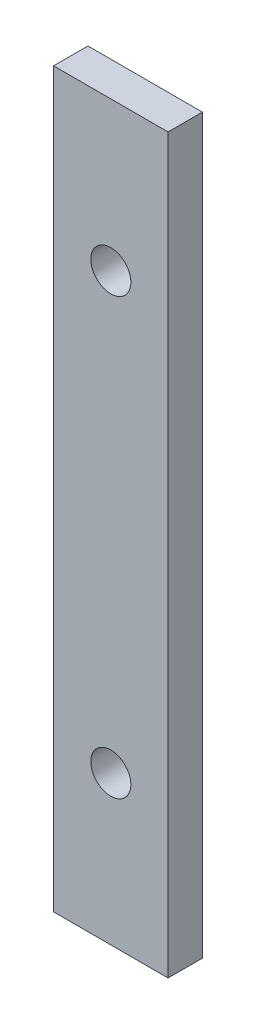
ISO-10303-21;
HEADER;
FILE_DESCRIPTION(('STEP AP214'),'2;1');
FILE_NAME('part.step','',(''),(''),'','','');
FILE_SCHEMA(('AUTOMOTIVE_DESIGN { 1 0 10303 214 1 1 1 1 }'));
ENDSEC;
DATA;
#1=APPLICATION_CONTEXT('core data for automotive mechanical design processes');
#2=APPLICATION_PROTOCOL_DEFINITION('international standard','automotive_design',2000,#1);
#3=PRODUCT_CONTEXT('',#1,'mechanical');
#4=PRODUCT('Part','Part','',(#3));
#5=PRODUCT_RELATED_PRODUCT_CATEGORY('part','',(#4));
#6=PRODUCT_DEFINITION_FORMATION('','',#4);
#7=PRODUCT_DEFINITION_CONTEXT('part definition',#1,'design');
#8=PRODUCT_DEFINITION('design','',#6,#7);
#9=PRODUCT_DEFINITION_SHAPE('','',#8);
#10=(LENGTH_UNIT() NAMED_UNIT(*) SI_UNIT(.MILLI.,.METRE.));
#11=(NAMED_UNIT(*) PLANE_ANGLE_UNIT() SI_UNIT($,.RADIAN.));
#12=(NAMED_UNIT(*) SI_UNIT($,.STERADIAN.) SOLID_ANGLE_UNIT());
#13=UNCERTAINTY_MEASURE_WITH_UNIT(LENGTH_MEASURE(1.E-05),#10,'distance_accuracy_value','');
#14=(GEOMETRIC_REPRESENTATION_CONTEXT(3) GLOBAL_UNCERTAINTY_ASSIGNED_CONTEXT((#13)) GLOBAL_UNIT_ASSIGNED_CONTEXT((#10,
#11,#12)) REPRESENTATION_CONTEXT('',''));
#15=CARTESIAN_POINT('',(0.,0.,0.));
#16=DIRECTION('',(0.,0.,1.));
#17=DIRECTION('',(1.,0.,0.));
#18=AXIS2_PLACEMENT_3D('',#15,#16,#17);
#19=CARTESIAN_POINT('',(0.,64.,3.));
#20=DIRECTION('',(0.,0.,-1.));
#21=DIRECTION('',(-1.,0.,0.));
#22=AXIS2_PLACEMENT_3D('',#19,#20,#21);
#23=PLANE('',#22);
#24=CARTESIAN_POINT('',(5.,51.,3.));
#25=DIRECTION('',(0.,0.,1.));
#26=DIRECTION('',(1.,0.,0.));
#27=AXIS2_PLACEMENT_3D('',#24,#25,#26);
#28=CIRCLE('',#27,1.75);
#29=CARTESIAN_POINT('',(6.75,51.,3.));
#30=VERTEX_POINT('',#29);
#31=EDGE_CURVE('E98',#30,#30,#28,.T.);
#32=ORIENTED_EDGE('',*,*,#31,.F.);
#33=EDGE_LOOP('',(#32));
#34=FACE_BOUND('',#33,.T.);
#35=DIRECTION('',(0.,-1.,0.));
#36=VECTOR('',#35,1.);
#37=CARTESIAN_POINT('',(0.,0.,3.));
#38=LINE('',#37,#36);
#39=CARTESIAN_POINT('',(0.,64.,3.));
#40=VERTEX_POINT('',#39);
#41=CARTESIAN_POINT('',(0.,0.,3.));
#42=VERTEX_POINT('',#41);
#43=EDGE_CURVE('E83',#40,#42,#38,.T.);
#44=ORIENTED_EDGE('',*,*,#43,.T.);
#45=DIRECTION('',(1.,0.,0.));
#46=VECTOR('',#45,1.);
#47=CARTESIAN_POINT('',(0.,0.,3.));
#48=LINE('',#47,#46);
#49=CARTESIAN_POINT('',(10.,0.,3.));
#50=VERTEX_POINT('',#49);
#51=EDGE_CURVE('E78',#42,#50,#48,.T.);
#52=ORIENTED_EDGE('',*,*,#51,.T.);
#53=DIRECTION('',(0.,1.,0.));
#54=VECTOR('',#53,1.);
#55=CARTESIAN_POINT('',(10.,0.,3.));
#56=LINE('',#55,#54);
#57=CARTESIAN_POINT('',(10.,64.,3.));
#58=VERTEX_POINT('',#57);
#59=EDGE_CURVE('E81',#50,#58,#56,.T.);
#60=ORIENTED_EDGE('',*,*,#59,.T.);
#61=DIRECTION('',(-1.,0.,0.));
#62=VECTOR('',#61,1.);
#63=CARTESIAN_POINT('',(0.,64.,3.));
#64=LINE('',#63,#62);
#65=EDGE_CURVE('E48',#58,#40,#64,.T.);
#66=ORIENTED_EDGE('',*,*,#65,.T.);
#67=EDGE_LOOP('',(#44,#52,#60,#66));
#68=FACE_BOUND('',#67,.T.);
#69=CARTESIAN_POINT('',(5.,13.,3.));
#70=DIRECTION('',(0.,0.,1.));
#71=DIRECTION('',(1.,0.,0.));
#72=AXIS2_PLACEMENT_3D('',#69,#70,#71);
#73=CIRCLE('',#72,1.75);
#74=CARTESIAN_POINT('',(6.75,13.,3.));
#75=VERTEX_POINT('',#74);
#76=EDGE_CURVE('E113',#75,#75,#73,.T.);
#77=ORIENTED_EDGE('',*,*,#76,.F.);
#78=EDGE_LOOP('',(#77));
#79=FACE_BOUND('',#78,.T.);
#80=ADVANCED_FACE('F31',(#34,#68,#79),#23,.F.);
#81=CARTESIAN_POINT('',(0.,64.,0.));
#82=DIRECTION('',(0.,0.,-1.));
#83=DIRECTION('',(-1.,0.,0.));
#84=AXIS2_PLACEMENT_3D('',#81,#82,#83);
#85=PLANE('',#84);
#86=CARTESIAN_POINT('',(5.,51.,0.));
#87=DIRECTION('',(0.,0.,1.));
#88=DIRECTION('',(1.,0.,0.));
#89=AXIS2_PLACEMENT_3D('',#86,#87,#88);
#90=CIRCLE('',#89,1.75);
#91=CARTESIAN_POINT('',(6.75,51.,0.));
#92=VERTEX_POINT('',#91);
#93=EDGE_CURVE('E110',#92,#92,#90,.T.);
#94=ORIENTED_EDGE('',*,*,#93,.T.);
#95=EDGE_LOOP('',(#94));
#96=FACE_BOUND('',#95,.T.);
#97=DIRECTION('',(0.,-1.,0.));
#98=VECTOR('',#97,1.);
#99=CARTESIAN_POINT('',(0.,0.,0.));
#100=LINE('',#99,#98);
#101=CARTESIAN_POINT('',(0.,64.,0.));
#102=VERTEX_POINT('',#101);
#103=CARTESIAN_POINT('',(0.,0.,0.));
#104=VERTEX_POINT('',#103);
#105=EDGE_CURVE('E95',#102,#104,#100,.T.);
#106=ORIENTED_EDGE('',*,*,#105,.F.);
#107=DIRECTION('',(-1.,0.,0.));
#108=VECTOR('',#107,1.);
#109=CARTESIAN_POINT('',(0.,64.,0.));
#110=LINE('',#109,#108);
#111=CARTESIAN_POINT('',(10.,64.,0.));
#112=VERTEX_POINT('',#111);
#113=EDGE_CURVE('E71',#112,#102,#110,.T.);
#114=ORIENTED_EDGE('',*,*,#113,.F.);
#115=DIRECTION('',(0.,1.,0.));
#116=VECTOR('',#115,1.);
#117=CARTESIAN_POINT('',(10.,0.,0.));
#118=LINE('',#117,#116);
#119=CARTESIAN_POINT('',(10.,0.,0.));
#120=VERTEX_POINT('',#119);
#121=EDGE_CURVE('E65',#120,#112,#118,.T.);
#122=ORIENTED_EDGE('',*,*,#121,.F.);
#123=DIRECTION('',(1.,0.,0.));
#124=VECTOR('',#123,1.);
#125=CARTESIAN_POINT('',(0.,0.,0.));
#126=LINE('',#125,#124);
#127=EDGE_CURVE('E87',#104,#120,#126,.T.);
#128=ORIENTED_EDGE('',*,*,#127,.F.);
#129=EDGE_LOOP('',(#106,#114,#122,#128));
#130=FACE_BOUND('',#129,.T.);
#131=CARTESIAN_POINT('',(5.,13.,0.));
#132=DIRECTION('',(0.,0.,1.));
#133=DIRECTION('',(1.,0.,0.));
#134=AXIS2_PLACEMENT_3D('',#131,#132,#133);
#135=CIRCLE('',#134,1.75);
#136=CARTESIAN_POINT('',(6.75,13.,0.));
#137=VERTEX_POINT('',#136);
#138=EDGE_CURVE('E116',#137,#137,#135,.T.);
#139=ORIENTED_EDGE('',*,*,#138,.T.);
#140=EDGE_LOOP('',(#139));
#141=FACE_BOUND('',#140,.T.);
#142=ADVANCED_FACE('F106',(#96,#130,#141),#85,.T.);
#143=CARTESIAN_POINT('',(0.,0.,3.));
#144=DIRECTION('',(1.,0.,0.));
#145=DIRECTION('',(0.,1.,0.));
#146=AXIS2_PLACEMENT_3D('',#143,#144,#145);
#147=PLANE('',#146);
#148=ORIENTED_EDGE('',*,*,#105,.T.);
#149=DIRECTION('',(0.,0.,-1.));
#150=VECTOR('',#149,1.);
#151=CARTESIAN_POINT('',(0.,0.,3.));
#152=LINE('',#151,#150);
#153=EDGE_CURVE('E11',#42,#104,#152,.T.);
#154=ORIENTED_EDGE('',*,*,#153,.F.);
#155=ORIENTED_EDGE('',*,*,#43,.F.);
#156=DIRECTION('',(0.,0.,-1.));
#157=VECTOR('',#156,1.);
#158=CARTESIAN_POINT('',(0.,64.,3.));
#159=LINE('',#158,#157);
#160=EDGE_CURVE('E91',#40,#102,#159,.T.);
#161=ORIENTED_EDGE('',*,*,#160,.T.);
#162=EDGE_LOOP('',(#148,#154,#155,#161));
#163=FACE_BOUND('',#162,.T.);
#164=ADVANCED_FACE('F33',(#163),#147,.F.);
#165=CARTESIAN_POINT('',(0.,0.,3.));
#166=DIRECTION('',(0.,1.,0.));
#167=DIRECTION('',(0.,0.,1.));
#168=AXIS2_PLACEMENT_3D('',#165,#166,#167);
#169=PLANE('',#168);
#170=ORIENTED_EDGE('',*,*,#127,.T.);
#171=DIRECTION('',(0.,0.,-1.));
#172=VECTOR('',#171,1.);
#173=CARTESIAN_POINT('',(10.,0.,3.));
#174=LINE('',#173,#172);
#175=EDGE_CURVE('E40',#50,#120,#174,.T.);
#176=ORIENTED_EDGE('',*,*,#175,.F.);
#177=ORIENTED_EDGE('',*,*,#51,.F.);
#178=ORIENTED_EDGE('',*,*,#153,.T.);
#179=EDGE_LOOP('',(#170,#176,#177,#178));
#180=FACE_BOUND('',#179,.T.);
#181=ADVANCED_FACE('F86',(#180),#169,.F.);
#182=CARTESIAN_POINT('',(10.,0.,3.));
#183=DIRECTION('',(-1.,0.,0.));
#184=DIRECTION('',(0.,0.,1.));
#185=AXIS2_PLACEMENT_3D('',#182,#183,#184);
#186=PLANE('',#185);
#187=ORIENTED_EDGE('',*,*,#121,.T.);
#188=DIRECTION('',(0.,0.,-1.));
#189=VECTOR('',#188,1.);
#190=CARTESIAN_POINT('',(10.,64.,3.));
#191=LINE('',#190,#189);
#192=EDGE_CURVE('E88',#58,#112,#191,.T.);
#193=ORIENTED_EDGE('',*,*,#192,.F.);
#194=ORIENTED_EDGE('',*,*,#59,.F.);
#195=ORIENTED_EDGE('',*,*,#175,.T.);
#196=EDGE_LOOP('',(#187,#193,#194,#195));
#197=FACE_BOUND('',#196,.T.);
#198=ADVANCED_FACE('F89',(#197),#186,.F.);
#199=CARTESIAN_POINT('',(0.,64.,3.));
#200=DIRECTION('',(0.,-1.,0.));
#201=DIRECTION('',(0.,0.,-1.));
#202=AXIS2_PLACEMENT_3D('',#199,#200,#201);
#203=PLANE('',#202);
#204=ORIENTED_EDGE('',*,*,#113,.T.);
#205=ORIENTED_EDGE('',*,*,#160,.F.);
#206=ORIENTED_EDGE('',*,*,#65,.F.);
#207=ORIENTED_EDGE('',*,*,#192,.T.);
#208=EDGE_LOOP('',(#204,#205,#206,#207));
#209=FACE_BOUND('',#208,.T.);
#210=ADVANCED_FACE('F103',(#209),#203,.F.);
#211=CARTESIAN_POINT('',(5.,51.,3.));
#212=DIRECTION('',(0.,0.,-1.));
#213=DIRECTION('',(-1.,0.,0.));
#214=AXIS2_PLACEMENT_3D('',#211,#212,#213);
#215=CYLINDRICAL_SURFACE('',#214,1.75);
#216=ORIENTED_EDGE('',*,*,#31,.T.);
#217=EDGE_LOOP('',(#216));
#218=FACE_BOUND('',#217,.T.);
#219=ORIENTED_EDGE('',*,*,#93,.F.);
#220=EDGE_LOOP('',(#219));
#221=FACE_BOUND('',#220,.T.);
#222=ADVANCED_FACE('F134',(#218,#221),#215,.F.);
#223=CARTESIAN_POINT('',(5.,13.,3.));
#224=DIRECTION('',(0.,0.,-1.));
#225=DIRECTION('',(-1.,0.,0.));
#226=AXIS2_PLACEMENT_3D('',#223,#224,#225);
#227=CYLINDRICAL_SURFACE('',#226,1.75);
#228=ORIENTED_EDGE('',*,*,#76,.T.);
#229=EDGE_LOOP('',(#228));
#230=FACE_BOUND('',#229,.T.);
#231=ORIENTED_EDGE('',*,*,#138,.F.);
#232=EDGE_LOOP('',(#231));
#233=FACE_BOUND('',#232,.T.);
#234=ADVANCED_FACE('F122',(#230,#233),#227,.F.);
#235=CLOSED_SHELL('',(#80,#142,#164,#181,#198,#210,#222,#234));
#236=MANIFOLD_SOLID_BREP('B2',#235);
#237=ADVANCED_BREP_SHAPE_REPRESENTATION('',(#18,#236),#14);
#238=SHAPE_DEFINITION_REPRESENTATION(#9,#237);
ENDSEC;
END-ISO-10303-21;
